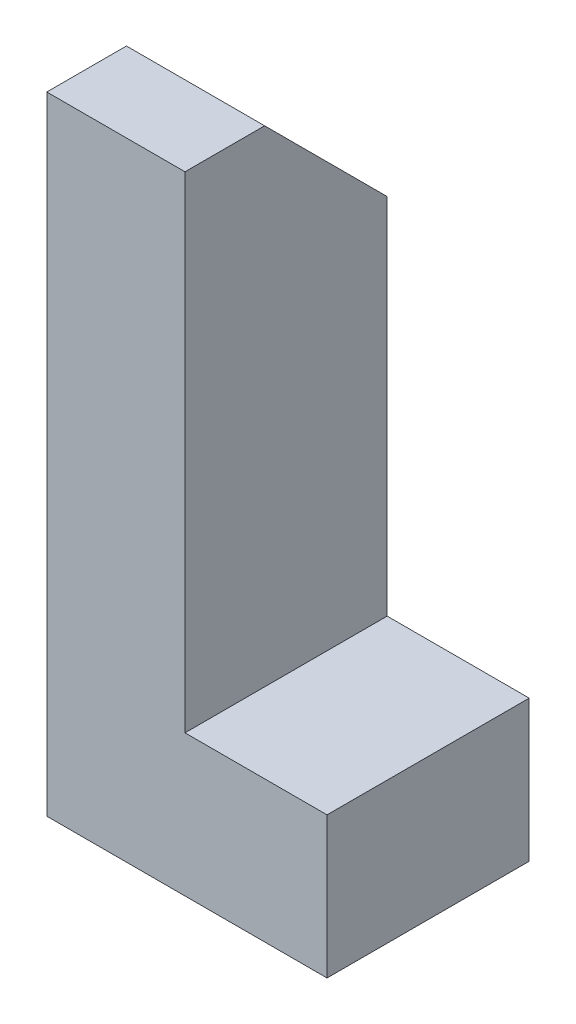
from build123d import *

# Parameters (mm, degrees)
EXTRUDE1_DEPTH = 25.146
CHAMFER1_SIZE  = 15.24


with BuildPart() as part:
    # Sketch1 → Extrude1 (new body)
    with BuildSketch(Plane.XY):
        Polygon((0, 0), (0, 17.575461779), (-17.668616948, 17.575461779), (-17.668616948, 78.014819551), (-34.857952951, 78.014819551), (-34.857952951, 0), align=None)
    extrude(amount=EXTRUDE1_DEPTH)

    # Chamfer1
    chamfer1_edges = [part.edges().sort_by_distance(p)[0] for p in [
        (-26.263284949, 78.014819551, 0),
    ]]
    chamfer(chamfer1_edges, length=CHAMFER1_SIZE)


solid = part.part
